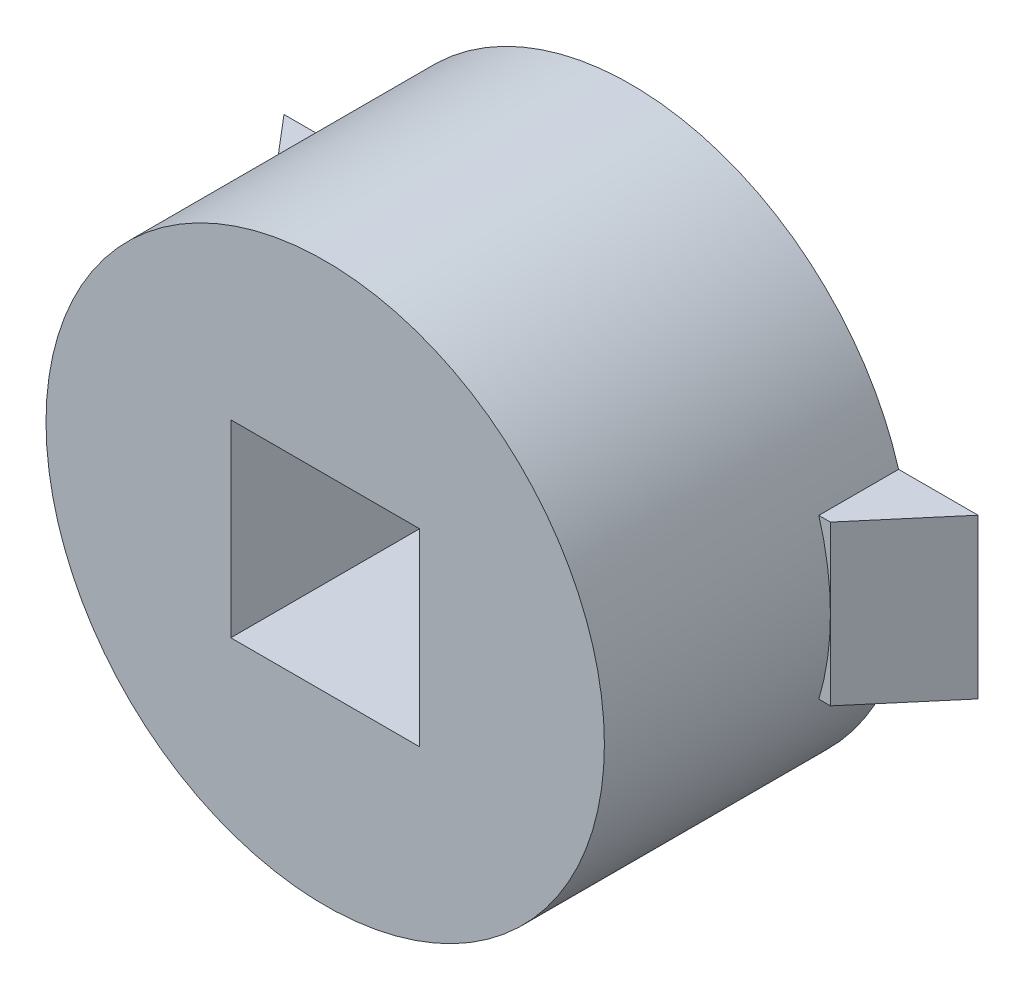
ISO-10303-21;
HEADER;
FILE_DESCRIPTION(('STEP AP214'),'2;1');
FILE_NAME('part.step','',(''),(''),'','','');
FILE_SCHEMA(('AUTOMOTIVE_DESIGN { 1 0 10303 214 1 1 1 1 }'));
ENDSEC;
DATA;
#1=APPLICATION_CONTEXT('core data for automotive mechanical design processes');
#2=APPLICATION_PROTOCOL_DEFINITION('international standard','automotive_design',2000,#1);
#3=PRODUCT_CONTEXT('',#1,'mechanical');
#4=PRODUCT('Part','Part','',(#3));
#5=PRODUCT_RELATED_PRODUCT_CATEGORY('part','',(#4));
#6=PRODUCT_DEFINITION_FORMATION('','',#4);
#7=PRODUCT_DEFINITION_CONTEXT('part definition',#1,'design');
#8=PRODUCT_DEFINITION('design','',#6,#7);
#9=PRODUCT_DEFINITION_SHAPE('','',#8);
#10=(LENGTH_UNIT() NAMED_UNIT(*) SI_UNIT(.MILLI.,.METRE.));
#11=(NAMED_UNIT(*) PLANE_ANGLE_UNIT() SI_UNIT($,.RADIAN.));
#12=(NAMED_UNIT(*) SI_UNIT($,.STERADIAN.) SOLID_ANGLE_UNIT());
#13=UNCERTAINTY_MEASURE_WITH_UNIT(LENGTH_MEASURE(1.E-05),#10,'distance_accuracy_value','');
#14=(GEOMETRIC_REPRESENTATION_CONTEXT(3) GLOBAL_UNCERTAINTY_ASSIGNED_CONTEXT((#13)) GLOBAL_UNIT_ASSIGNED_CONTEXT((#10,
#11,#12)) REPRESENTATION_CONTEXT('',''));
#15=CARTESIAN_POINT('',(0.,0.,0.));
#16=DIRECTION('',(0.,0.,1.));
#17=DIRECTION('',(1.,0.,0.));
#18=AXIS2_PLACEMENT_3D('',#15,#16,#17);
#19=CARTESIAN_POINT('',(0.,0.,6.));
#20=DIRECTION('',(0.,0.,-1.));
#21=DIRECTION('',(-1.,0.,0.));
#22=AXIS2_PLACEMENT_3D('',#19,#20,#21);
#23=PLANE('',#22);
#24=DIRECTION('',(-1.,0.,0.));
#25=VECTOR('',#24,1.);
#26=CARTESIAN_POINT('',(15.9000943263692,-5.98550986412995,6.));
#27=LINE('',#26,#25);
#28=CARTESIAN_POINT('',(21.,-5.98550986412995,6.));
#29=VERTEX_POINT('',#28);
#30=CARTESIAN_POINT('',(20.1289262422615,-5.98550986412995,6.));
#31=VERTEX_POINT('',#30);
#32=EDGE_CURVE('E171',#29,#31,#27,.T.);
#33=ORIENTED_EDGE('',*,*,#32,.F.);
#34=DIRECTION('',(0.,1.,0.));
#35=VECTOR('',#34,1.);
#36=CARTESIAN_POINT('',(21.,0.,6.));
#37=LINE('',#36,#35);
#38=CARTESIAN_POINT('',(21.,0.,6.));
#39=VERTEX_POINT('',#38);
#40=EDGE_CURVE('E11',#29,#39,#37,.T.);
#41=ORIENTED_EDGE('',*,*,#40,.T.);
#42=CARTESIAN_POINT('',(0.,0.,6.));
#43=DIRECTION('',(0.,0.,-1.));
#44=DIRECTION('',(-1.,0.,0.));
#45=AXIS2_PLACEMENT_3D('',#42,#43,#44);
#46=CIRCLE('',#45,21.);
#47=EDGE_CURVE('E228',#39,#31,#46,.T.);
#48=ORIENTED_EDGE('',*,*,#47,.T.);
#49=EDGE_LOOP('',(#33,#41,#48));
#50=FACE_BOUND('',#49,.T.);
#51=ADVANCED_FACE('F39',(#50),#23,.F.);
#52=CARTESIAN_POINT('',(0.,0.,6.));
#53=DIRECTION('',(0.,0.,1.));
#54=DIRECTION('',(1.,0.,0.));
#55=AXIS2_PLACEMENT_3D('',#52,#53,#54);
#56=PLANE('',#55);
#57=DIRECTION('',(0.,1.,0.));
#58=VECTOR('',#57,1.);
#59=CARTESIAN_POINT('',(-21.,0.,6.));
#60=LINE('',#59,#58);
#61=CARTESIAN_POINT('',(-21.,-5.98550986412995,6.));
#62=VERTEX_POINT('',#61);
#63=CARTESIAN_POINT('',(-21.,0.,6.));
#64=VERTEX_POINT('',#63);
#65=EDGE_CURVE('E62',#62,#64,#60,.T.);
#66=ORIENTED_EDGE('',*,*,#65,.F.);
#67=DIRECTION('',(-1.,0.,0.));
#68=VECTOR('',#67,1.);
#69=CARTESIAN_POINT('',(-15.9000943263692,-5.98550986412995,6.));
#70=LINE('',#69,#68);
#71=CARTESIAN_POINT('',(-20.1289262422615,-5.98550986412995,6.));
#72=VERTEX_POINT('',#71);
#73=EDGE_CURVE('E151',#72,#62,#70,.T.);
#74=ORIENTED_EDGE('',*,*,#73,.F.);
#75=CARTESIAN_POINT('',(0.,0.,6.));
#76=DIRECTION('',(0.,0.,1.));
#77=DIRECTION('',(1.,0.,0.));
#78=AXIS2_PLACEMENT_3D('',#75,#76,#77);
#79=CIRCLE('',#78,21.);
#80=EDGE_CURVE('E236',#64,#72,#79,.T.);
#81=ORIENTED_EDGE('',*,*,#80,.F.);
#82=EDGE_LOOP('',(#66,#74,#81));
#83=FACE_BOUND('',#82,.T.);
#84=ADVANCED_FACE('F271',(#83),#56,.T.);
#85=CARTESIAN_POINT('',(0.,0.,23.));
#86=DIRECTION('',(0.,0.,-1.));
#87=DIRECTION('',(-1.,0.,0.));
#88=AXIS2_PLACEMENT_3D('',#85,#86,#87);
#89=CYLINDRICAL_SURFACE('',#88,21.);
#90=CARTESIAN_POINT('',(0.,0.,0.));
#91=DIRECTION('',(0.,0.,1.));
#92=DIRECTION('',(1.,0.,0.));
#93=AXIS2_PLACEMENT_3D('',#90,#91,#92);
#94=CIRCLE('',#93,21.);
#95=CARTESIAN_POINT('',(20.1289262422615,5.98550986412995,0.));
#96=VERTEX_POINT('',#95);
#97=CARTESIAN_POINT('',(-20.1289262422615,5.98550986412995,0.));
#98=VERTEX_POINT('',#97);
#99=EDGE_CURVE('E229',#96,#98,#94,.T.);
#100=ORIENTED_EDGE('',*,*,#99,.T.);
#101=DIRECTION('',(0.,0.,-1.));
#102=VECTOR('',#101,1.);
#103=CARTESIAN_POINT('',(-20.1289262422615,5.98550986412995,23.));
#104=LINE('',#103,#102);
#105=CARTESIAN_POINT('',(-20.1289262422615,5.98550986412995,6.));
#106=VERTEX_POINT('',#105);
#107=EDGE_CURVE('E161',#98,#106,#104,.F.);
#108=ORIENTED_EDGE('',*,*,#107,.T.);
#109=EDGE_CURVE('E237',#106,#64,#79,.T.);
#110=ORIENTED_EDGE('',*,*,#109,.T.);
#111=ORIENTED_EDGE('',*,*,#80,.T.);
#112=DIRECTION('',(0.,0.,-1.));
#113=VECTOR('',#112,1.);
#114=CARTESIAN_POINT('',(-20.1289262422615,-5.98550986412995,23.));
#115=LINE('',#114,#113);
#116=CARTESIAN_POINT('',(-20.1289262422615,-5.98550986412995,0.));
#117=VERTEX_POINT('',#116);
#118=EDGE_CURVE('E159',#72,#117,#115,.T.);
#119=ORIENTED_EDGE('',*,*,#118,.T.);
#120=CARTESIAN_POINT('',(20.1289262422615,-5.98550986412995,0.));
#121=VERTEX_POINT('',#120);
#122=EDGE_CURVE('E157',#117,#121,#94,.T.);
#123=ORIENTED_EDGE('',*,*,#122,.T.);
#124=DIRECTION('',(0.,0.,-1.));
#125=VECTOR('',#124,1.);
#126=CARTESIAN_POINT('',(20.1289262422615,-5.98550986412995,23.));
#127=LINE('',#126,#125);
#128=EDGE_CURVE('E177',#121,#31,#127,.F.);
#129=ORIENTED_EDGE('',*,*,#128,.T.);
#130=ORIENTED_EDGE('',*,*,#47,.F.);
#131=CARTESIAN_POINT('',(20.1289262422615,5.98550986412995,6.));
#132=VERTEX_POINT('',#131);
#133=EDGE_CURVE('E233',#132,#39,#46,.T.);
#134=ORIENTED_EDGE('',*,*,#133,.F.);
#135=DIRECTION('',(0.,0.,-1.));
#136=VECTOR('',#135,1.);
#137=CARTESIAN_POINT('',(20.1289262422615,5.98550986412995,23.));
#138=LINE('',#137,#136);
#139=EDGE_CURVE('E186',#132,#96,#138,.T.);
#140=ORIENTED_EDGE('',*,*,#139,.T.);
#141=EDGE_LOOP('',(#100,#108,#110,#111,#119,#123,#129,#130,#134,#140));
#142=FACE_BOUND('',#141,.T.);
#143=CARTESIAN_POINT('',(0.,0.,23.));
#144=DIRECTION('',(0.,0.,1.));
#145=DIRECTION('',(1.,0.,0.));
#146=AXIS2_PLACEMENT_3D('',#143,#144,#145);
#147=CIRCLE('',#146,21.);
#148=CARTESIAN_POINT('',(21.,0.,23.));
#149=VERTEX_POINT('',#148);
#150=EDGE_CURVE('E225',#149,#149,#147,.T.);
#151=ORIENTED_EDGE('',*,*,#150,.F.);
#152=EDGE_LOOP('',(#151));
#153=FACE_BOUND('',#152,.T.);
#154=ADVANCED_FACE('F41',(#142,#153),#89,.T.);
#155=CARTESIAN_POINT('',(0.,0.,23.));
#156=DIRECTION('',(0.,0.,1.));
#157=DIRECTION('',(1.,0.,0.));
#158=AXIS2_PLACEMENT_3D('',#155,#156,#157);
#159=PLANE('',#158);
#160=DIRECTION('',(0.,1.,0.));
#161=VECTOR('',#160,1.);
#162=CARTESIAN_POINT('',(7.1,-7.1,23.));
#163=LINE('',#162,#161);
#164=CARTESIAN_POINT('',(7.1,-7.1,23.));
#165=VERTEX_POINT('',#164);
#166=CARTESIAN_POINT('',(7.1,7.1,23.));
#167=VERTEX_POINT('',#166);
#168=EDGE_CURVE('E207',#165,#167,#163,.T.);
#169=ORIENTED_EDGE('',*,*,#168,.F.);
#170=DIRECTION('',(1.,0.,0.));
#171=VECTOR('',#170,1.);
#172=CARTESIAN_POINT('',(-7.1,-7.1,23.));
#173=LINE('',#172,#171);
#174=CARTESIAN_POINT('',(-7.1,-7.1,23.));
#175=VERTEX_POINT('',#174);
#176=EDGE_CURVE('E197',#175,#165,#173,.T.);
#177=ORIENTED_EDGE('',*,*,#176,.F.);
#178=DIRECTION('',(0.,-1.,0.));
#179=VECTOR('',#178,1.);
#180=CARTESIAN_POINT('',(-7.1,-7.1,23.));
#181=LINE('',#180,#179);
#182=CARTESIAN_POINT('',(-7.1,7.1,23.));
#183=VERTEX_POINT('',#182);
#184=EDGE_CURVE('E212',#183,#175,#181,.T.);
#185=ORIENTED_EDGE('',*,*,#184,.F.);
#186=DIRECTION('',(-1.,0.,0.));
#187=VECTOR('',#186,1.);
#188=CARTESIAN_POINT('',(-7.1,7.1,23.));
#189=LINE('',#188,#187);
#190=EDGE_CURVE('E209',#167,#183,#189,.T.);
#191=ORIENTED_EDGE('',*,*,#190,.F.);
#192=EDGE_LOOP('',(#169,#177,#185,#191));
#193=FACE_BOUND('',#192,.T.);
#194=ORIENTED_EDGE('',*,*,#150,.T.);
#195=EDGE_LOOP('',(#194));
#196=FACE_BOUND('',#195,.T.);
#197=ADVANCED_FACE('F278',(#193,#196),#159,.T.);
#198=CARTESIAN_POINT('',(0.,0.,0.));
#199=DIRECTION('',(0.,0.,1.));
#200=DIRECTION('',(1.,0.,0.));
#201=AXIS2_PLACEMENT_3D('',#198,#199,#200);
#202=PLANE('',#201);
#203=ORIENTED_EDGE('',*,*,#122,.F.);
#204=DIRECTION('',(-1.,0.,0.));
#205=VECTOR('',#204,1.);
#206=CARTESIAN_POINT('',(-15.9000943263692,-5.98550986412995,0.));
#207=LINE('',#206,#205);
#208=CARTESIAN_POINT('',(-26.0999056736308,-5.98550986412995,0.));
#209=VERTEX_POINT('',#208);
#210=EDGE_CURVE('E142',#117,#209,#207,.T.);
#211=ORIENTED_EDGE('',*,*,#210,.T.);
#212=DIRECTION('',(0.,1.,0.));
#213=VECTOR('',#212,1.);
#214=CARTESIAN_POINT('',(-26.0999056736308,-5.98550986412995,0.));
#215=LINE('',#214,#213);
#216=CARTESIAN_POINT('',(-26.0999056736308,5.98550986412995,0.));
#217=VERTEX_POINT('',#216);
#218=EDGE_CURVE('E132',#209,#217,#215,.T.);
#219=ORIENTED_EDGE('',*,*,#218,.T.);
#220=DIRECTION('',(1.,0.,0.));
#221=VECTOR('',#220,1.);
#222=CARTESIAN_POINT('',(-15.9000943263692,5.98550986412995,0.));
#223=LINE('',#222,#221);
#224=EDGE_CURVE('E143',#217,#98,#223,.T.);
#225=ORIENTED_EDGE('',*,*,#224,.T.);
#226=ORIENTED_EDGE('',*,*,#99,.F.);
#227=DIRECTION('',(1.,0.,0.));
#228=VECTOR('',#227,1.);
#229=CARTESIAN_POINT('',(15.9000943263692,5.98550986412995,0.));
#230=LINE('',#229,#228);
#231=CARTESIAN_POINT('',(26.0999056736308,5.98550986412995,0.));
#232=VERTEX_POINT('',#231);
#233=EDGE_CURVE('E174',#96,#232,#230,.T.);
#234=ORIENTED_EDGE('',*,*,#233,.T.);
#235=DIRECTION('',(0.,-1.,0.));
#236=VECTOR('',#235,1.);
#237=CARTESIAN_POINT('',(26.0999056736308,-5.98550986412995,0.));
#238=LINE('',#237,#236);
#239=CARTESIAN_POINT('',(26.0999056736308,-5.98550986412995,0.));
#240=VERTEX_POINT('',#239);
#241=EDGE_CURVE('E170',#232,#240,#238,.T.);
#242=ORIENTED_EDGE('',*,*,#241,.T.);
#243=DIRECTION('',(-1.,0.,0.));
#244=VECTOR('',#243,1.);
#245=CARTESIAN_POINT('',(15.9000943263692,-5.98550986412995,0.));
#246=LINE('',#245,#244);
#247=EDGE_CURVE('E180',#240,#121,#246,.T.);
#248=ORIENTED_EDGE('',*,*,#247,.T.);
#249=EDGE_LOOP('',(#203,#211,#219,#225,#226,#234,#242,#248));
#250=FACE_BOUND('',#249,.T.);
#251=CARTESIAN_POINT('',(0.,0.,0.));
#252=DIRECTION('',(0.,0.,1.));
#253=DIRECTION('',(1.,0.,0.));
#254=AXIS2_PLACEMENT_3D('',#251,#252,#253);
#255=CIRCLE('',#254,6.5);
#256=CARTESIAN_POINT('',(6.5,0.,0.));
#257=VERTEX_POINT('',#256);
#258=EDGE_CURVE('E192',#257,#257,#255,.T.);
#259=ORIENTED_EDGE('',*,*,#258,.T.);
#260=EDGE_LOOP('',(#259));
#261=FACE_BOUND('',#260,.T.);
#262=ADVANCED_FACE('F154',(#250,#261),#202,.F.);
#263=CARTESIAN_POINT('',(7.1,-7.1,1.));
#264=DIRECTION('',(1.,0.,0.));
#265=DIRECTION('',(0.,0.,-1.));
#266=AXIS2_PLACEMENT_3D('',#263,#264,#265);
#267=PLANE('',#266);
#268=ORIENTED_EDGE('',*,*,#168,.T.);
#269=DIRECTION('',(0.,0.,1.));
#270=VECTOR('',#269,1.);
#271=CARTESIAN_POINT('',(7.1,7.1,1.));
#272=LINE('',#271,#270);
#273=CARTESIAN_POINT('',(7.1,7.1,1.));
#274=VERTEX_POINT('',#273);
#275=EDGE_CURVE('E206',#274,#167,#272,.T.);
#276=ORIENTED_EDGE('',*,*,#275,.F.);
#277=DIRECTION('',(0.,1.,0.));
#278=VECTOR('',#277,1.);
#279=CARTESIAN_POINT('',(7.1,-7.1,1.));
#280=LINE('',#279,#278);
#281=CARTESIAN_POINT('',(7.1,-7.1,1.));
#282=VERTEX_POINT('',#281);
#283=EDGE_CURVE('E193',#282,#274,#280,.T.);
#284=ORIENTED_EDGE('',*,*,#283,.F.);
#285=DIRECTION('',(0.,0.,1.));
#286=VECTOR('',#285,1.);
#287=CARTESIAN_POINT('',(7.1,-7.1,1.));
#288=LINE('',#287,#286);
#289=EDGE_CURVE('E217',#282,#165,#288,.T.);
#290=ORIENTED_EDGE('',*,*,#289,.T.);
#291=EDGE_LOOP('',(#268,#276,#284,#290));
#292=FACE_BOUND('',#291,.T.);
#293=ADVANCED_FACE('F357',(#292),#267,.F.);
#294=CARTESIAN_POINT('',(-7.1,-7.1,1.));
#295=DIRECTION('',(0.,-1.,0.));
#296=DIRECTION('',(0.,0.,-1.));
#297=AXIS2_PLACEMENT_3D('',#294,#295,#296);
#298=PLANE('',#297);
#299=ORIENTED_EDGE('',*,*,#176,.T.);
#300=ORIENTED_EDGE('',*,*,#289,.F.);
#301=DIRECTION('',(1.,0.,0.));
#302=VECTOR('',#301,1.);
#303=CARTESIAN_POINT('',(-7.1,-7.1,1.));
#304=LINE('',#303,#302);
#305=CARTESIAN_POINT('',(-7.1,-7.1,1.));
#306=VERTEX_POINT('',#305);
#307=EDGE_CURVE('E203',#306,#282,#304,.T.);
#308=ORIENTED_EDGE('',*,*,#307,.F.);
#309=DIRECTION('',(0.,0.,1.));
#310=VECTOR('',#309,1.);
#311=CARTESIAN_POINT('',(-7.1,-7.1,1.));
#312=LINE('',#311,#310);
#313=EDGE_CURVE('E219',#306,#175,#312,.T.);
#314=ORIENTED_EDGE('',*,*,#313,.T.);
#315=EDGE_LOOP('',(#299,#300,#308,#314));
#316=FACE_BOUND('',#315,.T.);
#317=ADVANCED_FACE('F388',(#316),#298,.F.);
#318=CARTESIAN_POINT('',(-7.1,-7.1,1.));
#319=DIRECTION('',(-1.,0.,0.));
#320=DIRECTION('',(0.,0.,1.));
#321=AXIS2_PLACEMENT_3D('',#318,#319,#320);
#322=PLANE('',#321);
#323=ORIENTED_EDGE('',*,*,#184,.T.);
#324=ORIENTED_EDGE('',*,*,#313,.F.);
#325=DIRECTION('',(0.,-1.,0.));
#326=VECTOR('',#325,1.);
#327=CARTESIAN_POINT('',(-7.1,-7.1,1.));
#328=LINE('',#327,#326);
#329=CARTESIAN_POINT('',(-7.1,7.1,1.));
#330=VERTEX_POINT('',#329);
#331=EDGE_CURVE('E200',#330,#306,#328,.T.);
#332=ORIENTED_EDGE('',*,*,#331,.F.);
#333=DIRECTION('',(0.,0.,1.));
#334=VECTOR('',#333,1.);
#335=CARTESIAN_POINT('',(-7.1,7.1,1.));
#336=LINE('',#335,#334);
#337=EDGE_CURVE('E221',#330,#183,#336,.T.);
#338=ORIENTED_EDGE('',*,*,#337,.T.);
#339=EDGE_LOOP('',(#323,#324,#332,#338));
#340=FACE_BOUND('',#339,.T.);
#341=ADVANCED_FACE('F398',(#340),#322,.F.);
#342=CARTESIAN_POINT('',(-7.1,7.1,1.));
#343=DIRECTION('',(0.,1.,0.));
#344=DIRECTION('',(0.,0.,1.));
#345=AXIS2_PLACEMENT_3D('',#342,#343,#344);
#346=PLANE('',#345);
#347=ORIENTED_EDGE('',*,*,#190,.T.);
#348=ORIENTED_EDGE('',*,*,#337,.F.);
#349=DIRECTION('',(-1.,0.,0.));
#350=VECTOR('',#349,1.);
#351=CARTESIAN_POINT('',(-7.1,7.1,1.));
#352=LINE('',#351,#350);
#353=EDGE_CURVE('E196',#274,#330,#352,.T.);
#354=ORIENTED_EDGE('',*,*,#353,.F.);
#355=ORIENTED_EDGE('',*,*,#275,.T.);
#356=EDGE_LOOP('',(#347,#348,#354,#355));
#357=FACE_BOUND('',#356,.T.);
#358=ADVANCED_FACE('F408',(#357),#346,.F.);
#359=CARTESIAN_POINT('',(0.,0.,1.));
#360=DIRECTION('',(0.,0.,-1.));
#361=DIRECTION('',(-1.,0.,0.));
#362=AXIS2_PLACEMENT_3D('',#359,#360,#361);
#363=PLANE('',#362);
#364=CARTESIAN_POINT('',(0.,0.,1.));
#365=DIRECTION('',(0.,0.,1.));
#366=DIRECTION('',(1.,0.,0.));
#367=AXIS2_PLACEMENT_3D('',#364,#365,#366);
#368=CIRCLE('',#367,6.5);
#369=CARTESIAN_POINT('',(6.5,0.,1.));
#370=VERTEX_POINT('',#369);
#371=EDGE_CURVE('E189',#370,#370,#368,.T.);
#372=ORIENTED_EDGE('',*,*,#371,.F.);
#373=EDGE_LOOP('',(#372));
#374=FACE_BOUND('',#373,.T.);
#375=ORIENTED_EDGE('',*,*,#283,.T.);
#376=ORIENTED_EDGE('',*,*,#353,.T.);
#377=ORIENTED_EDGE('',*,*,#331,.T.);
#378=ORIENTED_EDGE('',*,*,#307,.T.);
#379=EDGE_LOOP('',(#375,#376,#377,#378));
#380=FACE_BOUND('',#379,.T.);
#381=ADVANCED_FACE('F418',(#374,#380),#363,.F.);
#382=CARTESIAN_POINT('',(0.,0.,-21.));
#383=DIRECTION('',(0.,0.,1.));
#384=DIRECTION('',(1.,0.,0.));
#385=AXIS2_PLACEMENT_3D('',#382,#383,#384);
#386=CYLINDRICAL_SURFACE('',#385,6.5);
#387=ORIENTED_EDGE('',*,*,#371,.T.);
#388=EDGE_LOOP('',(#387));
#389=FACE_BOUND('',#388,.T.);
#390=ORIENTED_EDGE('',*,*,#258,.F.);
#391=EDGE_LOOP('',(#390));
#392=FACE_BOUND('',#391,.T.);
#393=ADVANCED_FACE('F348',(#389,#392),#386,.F.);
#394=CARTESIAN_POINT('',(15.9000943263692,5.98550986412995,6.));
#395=DIRECTION('',(0.,1.,0.));
#396=DIRECTION('',(0.,0.,1.));
#397=AXIS2_PLACEMENT_3D('',#394,#395,#396);
#398=PLANE('',#397);
#399=DIRECTION('',(-0.647641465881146,0.,0.761945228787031));
#400=VECTOR('',#399,1.);
#401=CARTESIAN_POINT('',(18.8608982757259,5.98550986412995,8.51663680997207));
#402=LINE('',#401,#400);
#403=CARTESIAN_POINT('',(21.,5.98550986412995,6.));
#404=VERTEX_POINT('',#403);
#405=EDGE_CURVE('E54',#232,#404,#402,.T.);
#406=ORIENTED_EDGE('',*,*,#405,.F.);
#407=ORIENTED_EDGE('',*,*,#233,.F.);
#408=ORIENTED_EDGE('',*,*,#139,.F.);
#409=DIRECTION('',(1.,0.,0.));
#410=VECTOR('',#409,1.);
#411=CARTESIAN_POINT('',(15.9000943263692,5.98550986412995,6.));
#412=LINE('',#411,#410);
#413=EDGE_CURVE('E173',#132,#404,#412,.T.);
#414=ORIENTED_EDGE('',*,*,#413,.T.);
#415=EDGE_LOOP('',(#406,#407,#408,#414));
#416=FACE_BOUND('',#415,.T.);
#417=ADVANCED_FACE('F245',(#416),#398,.T.);
#418=CARTESIAN_POINT('',(15.9000943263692,-5.98550986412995,6.));
#419=DIRECTION('',(0.,-1.,0.));
#420=DIRECTION('',(0.,0.,-1.));
#421=AXIS2_PLACEMENT_3D('',#418,#419,#420);
#422=PLANE('',#421);
#423=DIRECTION('',(0.647641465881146,0.,-0.761945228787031));
#424=VECTOR('',#423,1.);
#425=CARTESIAN_POINT('',(26.0999056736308,-5.98550986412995,0.));
#426=LINE('',#425,#424);
#427=EDGE_CURVE('E152',#29,#240,#426,.T.);
#428=ORIENTED_EDGE('',*,*,#427,.F.);
#429=ORIENTED_EDGE('',*,*,#32,.T.);
#430=ORIENTED_EDGE('',*,*,#128,.F.);
#431=ORIENTED_EDGE('',*,*,#247,.F.);
#432=EDGE_LOOP('',(#428,#429,#430,#431));
#433=FACE_BOUND('',#432,.T.);
#434=ADVANCED_FACE('F259',(#433),#422,.T.);
#435=ORIENTED_EDGE('',*,*,#133,.T.);
#436=EDGE_CURVE('E43',#39,#404,#37,.T.);
#437=ORIENTED_EDGE('',*,*,#436,.T.);
#438=ORIENTED_EDGE('',*,*,#413,.F.);
#439=EDGE_LOOP('',(#435,#437,#438));
#440=FACE_BOUND('',#439,.T.);
#441=ADVANCED_FACE('F242',(#440),#23,.F.);
#442=CARTESIAN_POINT('',(-15.9000943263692,5.98550986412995,6.));
#443=DIRECTION('',(0.,1.,0.));
#444=DIRECTION('',(0.,0.,1.));
#445=AXIS2_PLACEMENT_3D('',#442,#443,#444);
#446=PLANE('',#445);
#447=DIRECTION('',(-0.647641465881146,0.,-0.761945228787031));
#448=VECTOR('',#447,1.);
#449=CARTESIAN_POINT('',(-18.8608982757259,5.98550986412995,8.51663680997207));
#450=LINE('',#449,#448);
#451=CARTESIAN_POINT('',(-21.,5.98550986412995,6.));
#452=VERTEX_POINT('',#451);
#453=EDGE_CURVE('E137',#452,#217,#450,.T.);
#454=ORIENTED_EDGE('',*,*,#453,.F.);
#455=DIRECTION('',(1.,0.,0.));
#456=VECTOR('',#455,1.);
#457=CARTESIAN_POINT('',(-15.9000943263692,5.98550986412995,6.));
#458=LINE('',#457,#456);
#459=EDGE_CURVE('E165',#452,#106,#458,.T.);
#460=ORIENTED_EDGE('',*,*,#459,.T.);
#461=ORIENTED_EDGE('',*,*,#107,.F.);
#462=ORIENTED_EDGE('',*,*,#224,.F.);
#463=EDGE_LOOP('',(#454,#460,#461,#462));
#464=FACE_BOUND('',#463,.T.);
#465=ADVANCED_FACE('F264',(#464),#446,.T.);
#466=CARTESIAN_POINT('',(-15.9000943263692,-5.98550986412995,6.));
#467=DIRECTION('',(0.,-1.,0.));
#468=DIRECTION('',(0.,0.,-1.));
#469=AXIS2_PLACEMENT_3D('',#466,#467,#468);
#470=PLANE('',#469);
#471=DIRECTION('',(0.647641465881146,0.,0.761945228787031));
#472=VECTOR('',#471,1.);
#473=CARTESIAN_POINT('',(-26.0999056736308,-5.98550986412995,0.));
#474=LINE('',#473,#472);
#475=EDGE_CURVE('E135',#209,#62,#474,.T.);
#476=ORIENTED_EDGE('',*,*,#475,.F.);
#477=ORIENTED_EDGE('',*,*,#210,.F.);
#478=ORIENTED_EDGE('',*,*,#118,.F.);
#479=ORIENTED_EDGE('',*,*,#73,.T.);
#480=EDGE_LOOP('',(#476,#477,#478,#479));
#481=FACE_BOUND('',#480,.T.);
#482=ADVANCED_FACE('F148',(#481),#470,.T.);
#483=EDGE_CURVE('E239',#64,#452,#60,.T.);
#484=ORIENTED_EDGE('',*,*,#483,.F.);
#485=ORIENTED_EDGE('',*,*,#109,.F.);
#486=ORIENTED_EDGE('',*,*,#459,.F.);
#487=EDGE_LOOP('',(#484,#485,#486));
#488=FACE_BOUND('',#487,.T.);
#489=ADVANCED_FACE('F268',(#488),#56,.T.);
#490=CARTESIAN_POINT('',(-26.0999056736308,8.01449013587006,0.));
#491=DIRECTION('',(0.761945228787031,0.,-0.647641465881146));
#492=DIRECTION('',(-0.647641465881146,0.,-0.761945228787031));
#493=AXIS2_PLACEMENT_3D('',#490,#491,#492);
#494=PLANE('',#493);
#495=ORIENTED_EDGE('',*,*,#453,.T.);
#496=ORIENTED_EDGE('',*,*,#218,.F.);
#497=ORIENTED_EDGE('',*,*,#475,.T.);
#498=ORIENTED_EDGE('',*,*,#65,.T.);
#499=ORIENTED_EDGE('',*,*,#483,.T.);
#500=EDGE_LOOP('',(#495,#496,#497,#498,#499));
#501=FACE_BOUND('',#500,.T.);
#502=ADVANCED_FACE('F134',(#501),#494,.F.);
#503=CARTESIAN_POINT('',(26.0999056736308,8.01449013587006,0.));
#504=DIRECTION('',(-0.761945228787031,0.,-0.647641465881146));
#505=DIRECTION('',(-0.647641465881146,0.,0.761945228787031));
#506=AXIS2_PLACEMENT_3D('',#503,#504,#505);
#507=PLANE('',#506);
#508=ORIENTED_EDGE('',*,*,#405,.T.);
#509=ORIENTED_EDGE('',*,*,#436,.F.);
#510=ORIENTED_EDGE('',*,*,#40,.F.);
#511=ORIENTED_EDGE('',*,*,#427,.T.);
#512=ORIENTED_EDGE('',*,*,#241,.F.);
#513=EDGE_LOOP('',(#508,#509,#510,#511,#512));
#514=FACE_BOUND('',#513,.T.);
#515=ADVANCED_FACE('F256',(#514),#507,.F.);
#516=CLOSED_SHELL('',(#51,#84,#154,#197,#262,#293,#317,#341,#358,#381,#393,#417,#434,#441,#465,
#482,#489,#502,#515));
#517=MANIFOLD_SOLID_BREP('B2',#516);
#518=ADVANCED_BREP_SHAPE_REPRESENTATION('',(#18,#517),#14);
#519=SHAPE_DEFINITION_REPRESENTATION(#9,#518);
ENDSEC;
END-ISO-10303-21;
